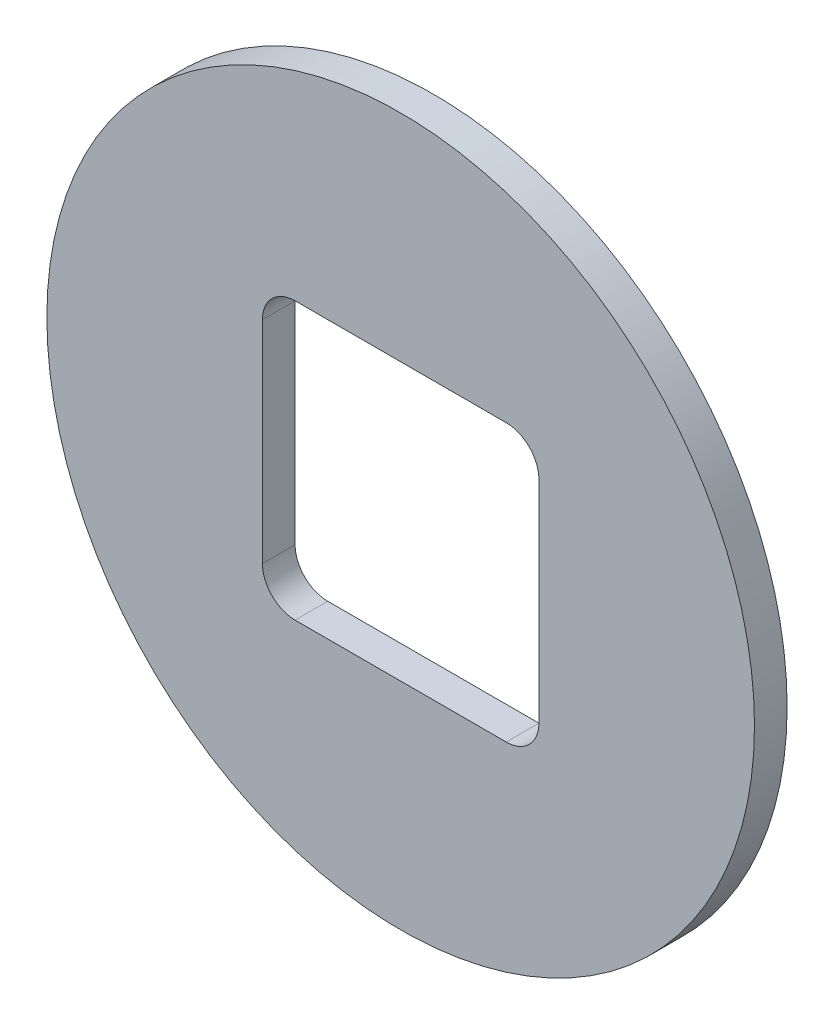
ISO-10303-21;
HEADER;
FILE_DESCRIPTION(('STEP AP214'),'2;1');
FILE_NAME('part.step','',(''),(''),'','','');
FILE_SCHEMA(('AUTOMOTIVE_DESIGN { 1 0 10303 214 1 1 1 1 }'));
ENDSEC;
DATA;
#1=APPLICATION_CONTEXT('core data for automotive mechanical design processes');
#2=APPLICATION_PROTOCOL_DEFINITION('international standard','automotive_design',2000,#1);
#3=PRODUCT_CONTEXT('',#1,'mechanical');
#4=PRODUCT('Part','Part','',(#3));
#5=PRODUCT_RELATED_PRODUCT_CATEGORY('part','',(#4));
#6=PRODUCT_DEFINITION_FORMATION('','',#4);
#7=PRODUCT_DEFINITION_CONTEXT('part definition',#1,'design');
#8=PRODUCT_DEFINITION('design','',#6,#7);
#9=PRODUCT_DEFINITION_SHAPE('','',#8);
#10=(LENGTH_UNIT() NAMED_UNIT(*) SI_UNIT(.MILLI.,.METRE.));
#11=(NAMED_UNIT(*) PLANE_ANGLE_UNIT() SI_UNIT($,.RADIAN.));
#12=(NAMED_UNIT(*) SI_UNIT($,.STERADIAN.) SOLID_ANGLE_UNIT());
#13=UNCERTAINTY_MEASURE_WITH_UNIT(LENGTH_MEASURE(1.E-05),#10,'distance_accuracy_value','');
#14=(GEOMETRIC_REPRESENTATION_CONTEXT(3) GLOBAL_UNCERTAINTY_ASSIGNED_CONTEXT((#13)) GLOBAL_UNIT_ASSIGNED_CONTEXT((#10,
#11,#12)) REPRESENTATION_CONTEXT('',''));
#15=CARTESIAN_POINT('',(0.,0.,0.));
#16=DIRECTION('',(0.,0.,1.));
#17=DIRECTION('',(1.,0.,0.));
#18=AXIS2_PLACEMENT_3D('',#15,#16,#17);
#19=CARTESIAN_POINT('',(0.,0.,0.));
#20=DIRECTION('',(0.,0.,1.));
#21=DIRECTION('',(1.,0.,0.));
#22=AXIS2_PLACEMENT_3D('',#19,#20,#21);
#23=PLANE('',#22);
#24=DIRECTION('',(1.,0.,0.));
#25=VECTOR('',#24,1.);
#26=CARTESIAN_POINT('',(12.7,-12.7,0.));
#27=LINE('',#26,#25);
#28=CARTESIAN_POINT('',(9.7,-12.7,0.));
#29=VERTEX_POINT('',#28);
#30=CARTESIAN_POINT('',(-9.7,-12.7,0.));
#31=VERTEX_POINT('',#30);
#32=EDGE_CURVE('E116',#29,#31,#27,.F.);
#33=ORIENTED_EDGE('',*,*,#32,.F.);
#34=CARTESIAN_POINT('',(9.7,-9.7,0.));
#35=DIRECTION('',(0.,0.,1.));
#36=DIRECTION('',(1.,0.,0.));
#37=AXIS2_PLACEMENT_3D('',#34,#35,#36);
#38=CIRCLE('',#37,3.);
#39=CARTESIAN_POINT('',(12.7,-9.7,0.));
#40=VERTEX_POINT('',#39);
#41=EDGE_CURVE('E87',#29,#40,#38,.T.);
#42=ORIENTED_EDGE('',*,*,#41,.T.);
#43=DIRECTION('',(0.,1.,0.));
#44=VECTOR('',#43,1.);
#45=CARTESIAN_POINT('',(12.7,12.7,0.));
#46=LINE('',#45,#44);
#47=CARTESIAN_POINT('',(12.7,9.7,0.));
#48=VERTEX_POINT('',#47);
#49=EDGE_CURVE('E80',#48,#40,#46,.F.);
#50=ORIENTED_EDGE('',*,*,#49,.F.);
#51=CARTESIAN_POINT('',(9.7,9.7,0.));
#52=DIRECTION('',(0.,0.,1.));
#53=DIRECTION('',(1.,0.,0.));
#54=AXIS2_PLACEMENT_3D('',#51,#52,#53);
#55=CIRCLE('',#54,3.);
#56=CARTESIAN_POINT('',(9.7,12.7,0.));
#57=VERTEX_POINT('',#56);
#58=EDGE_CURVE('E85',#48,#57,#55,.T.);
#59=ORIENTED_EDGE('',*,*,#58,.T.);
#60=DIRECTION('',(1.,0.,0.));
#61=VECTOR('',#60,1.);
#62=CARTESIAN_POINT('',(-12.7,12.7,0.));
#63=LINE('',#62,#61);
#64=CARTESIAN_POINT('',(-9.7,12.7,0.));
#65=VERTEX_POINT('',#64);
#66=EDGE_CURVE('E109',#65,#57,#63,.T.);
#67=ORIENTED_EDGE('',*,*,#66,.F.);
#68=CARTESIAN_POINT('',(-9.7,9.7,0.));
#69=DIRECTION('',(0.,0.,1.));
#70=DIRECTION('',(1.,0.,0.));
#71=AXIS2_PLACEMENT_3D('',#68,#69,#70);
#72=CIRCLE('',#71,3.);
#73=CARTESIAN_POINT('',(-12.7,9.7,0.));
#74=VERTEX_POINT('',#73);
#75=EDGE_CURVE('E114',#65,#74,#72,.T.);
#76=ORIENTED_EDGE('',*,*,#75,.T.);
#77=DIRECTION('',(0.,1.,0.));
#78=VECTOR('',#77,1.);
#79=CARTESIAN_POINT('',(-12.7,-12.7,0.));
#80=LINE('',#79,#78);
#81=CARTESIAN_POINT('',(-12.7,-9.7,0.));
#82=VERTEX_POINT('',#81);
#83=EDGE_CURVE('E111',#82,#74,#80,.T.);
#84=ORIENTED_EDGE('',*,*,#83,.F.);
#85=CARTESIAN_POINT('',(-9.7,-9.7,0.));
#86=DIRECTION('',(0.,0.,1.));
#87=DIRECTION('',(1.,0.,0.));
#88=AXIS2_PLACEMENT_3D('',#85,#86,#87);
#89=CIRCLE('',#88,3.);
#90=EDGE_CURVE('E118',#82,#31,#89,.T.);
#91=ORIENTED_EDGE('',*,*,#90,.T.);
#92=EDGE_LOOP('',(#33,#42,#50,#59,#67,#76,#84,#91));
#93=FACE_BOUND('',#92,.T.);
#94=CARTESIAN_POINT('',(0.,0.,0.));
#95=DIRECTION('',(0.,0.,1.));
#96=DIRECTION('',(1.,0.,0.));
#97=AXIS2_PLACEMENT_3D('',#94,#95,#96);
#98=CIRCLE('',#97,32.5);
#99=CARTESIAN_POINT('',(32.5,0.,0.));
#100=VERTEX_POINT('',#99);
#101=EDGE_CURVE('E21',#100,#100,#98,.T.);
#102=ORIENTED_EDGE('',*,*,#101,.F.);
#103=EDGE_LOOP('',(#102));
#104=FACE_BOUND('',#103,.T.);
#105=ADVANCED_FACE('F17',(#93,#104),#23,.F.);
#106=CARTESIAN_POINT('',(0.,0.,0.));
#107=DIRECTION('',(0.,0.,1.));
#108=DIRECTION('',(1.,0.,0.));
#109=AXIS2_PLACEMENT_3D('',#106,#107,#108);
#110=CYLINDRICAL_SURFACE('',#109,32.5);
#111=CARTESIAN_POINT('',(0.,0.,3.));
#112=DIRECTION('',(0.,0.,1.));
#113=DIRECTION('',(1.,0.,0.));
#114=AXIS2_PLACEMENT_3D('',#111,#112,#113);
#115=CIRCLE('',#114,32.5);
#116=CARTESIAN_POINT('',(32.5,0.,3.));
#117=VERTEX_POINT('',#116);
#118=EDGE_CURVE('E133',#117,#117,#115,.T.);
#119=ORIENTED_EDGE('',*,*,#118,.F.);
#120=EDGE_LOOP('',(#119));
#121=FACE_BOUND('',#120,.T.);
#122=ORIENTED_EDGE('',*,*,#101,.T.);
#123=EDGE_LOOP('',(#122));
#124=FACE_BOUND('',#123,.T.);
#125=ADVANCED_FACE('F191',(#121,#124),#110,.T.);
#126=CARTESIAN_POINT('',(9.7,9.7,-3.9108));
#127=DIRECTION('',(0.,0.,1.));
#128=DIRECTION('',(1.,0.,0.));
#129=AXIS2_PLACEMENT_3D('',#126,#127,#128);
#130=CYLINDRICAL_SURFACE('',#129,3.);
#131=DIRECTION('',(0.,0.,-1.));
#132=VECTOR('',#131,1.);
#133=CARTESIAN_POINT('',(9.7,12.7,0.));
#134=LINE('',#133,#132);
#135=CARTESIAN_POINT('',(9.7,12.7,3.));
#136=VERTEX_POINT('',#135);
#137=EDGE_CURVE('E97',#57,#136,#134,.F.);
#138=ORIENTED_EDGE('',*,*,#137,.F.);
#139=ORIENTED_EDGE('',*,*,#58,.F.);
#140=DIRECTION('',(0.,0.,1.));
#141=VECTOR('',#140,1.);
#142=CARTESIAN_POINT('',(12.7,9.7,0.));
#143=LINE('',#142,#141);
#144=CARTESIAN_POINT('',(12.7,9.7,3.));
#145=VERTEX_POINT('',#144);
#146=EDGE_CURVE('E91',#145,#48,#143,.F.);
#147=ORIENTED_EDGE('',*,*,#146,.F.);
#148=CARTESIAN_POINT('',(9.7,9.7,3.));
#149=DIRECTION('',(0.,0.,1.));
#150=DIRECTION('',(1.,0.,0.));
#151=AXIS2_PLACEMENT_3D('',#148,#149,#150);
#152=CIRCLE('',#151,3.);
#153=EDGE_CURVE('E131',#136,#145,#152,.F.);
#154=ORIENTED_EDGE('',*,*,#153,.F.);
#155=EDGE_LOOP('',(#138,#139,#147,#154));
#156=FACE_BOUND('',#155,.T.);
#157=ADVANCED_FACE('F94',(#156),#130,.F.);
#158=CARTESIAN_POINT('',(12.7,12.7,0.));
#159=DIRECTION('',(-1.,0.,0.));
#160=DIRECTION('',(0.,0.,1.));
#161=AXIS2_PLACEMENT_3D('',#158,#159,#160);
#162=PLANE('',#161);
#163=DIRECTION('',(0.,1.,0.));
#164=VECTOR('',#163,1.);
#165=CARTESIAN_POINT('',(12.7,0.,3.));
#166=LINE('',#165,#164);
#167=CARTESIAN_POINT('',(12.7,-9.7,3.));
#168=VERTEX_POINT('',#167);
#169=EDGE_CURVE('E101',#145,#168,#166,.F.);
#170=ORIENTED_EDGE('',*,*,#169,.F.);
#171=ORIENTED_EDGE('',*,*,#146,.T.);
#172=ORIENTED_EDGE('',*,*,#49,.T.);
#173=DIRECTION('',(0.,0.,1.));
#174=VECTOR('',#173,1.);
#175=CARTESIAN_POINT('',(12.7,-9.7,-3.9108));
#176=LINE('',#175,#174);
#177=EDGE_CURVE('E104',#40,#168,#176,.T.);
#178=ORIENTED_EDGE('',*,*,#177,.T.);
#179=EDGE_LOOP('',(#170,#171,#172,#178));
#180=FACE_BOUND('',#179,.T.);
#181=ADVANCED_FACE('F99',(#180),#162,.T.);
#182=CARTESIAN_POINT('',(9.7,-9.7,-3.9108));
#183=DIRECTION('',(0.,0.,1.));
#184=DIRECTION('',(1.,0.,0.));
#185=AXIS2_PLACEMENT_3D('',#182,#183,#184);
#186=CYLINDRICAL_SURFACE('',#185,3.);
#187=ORIENTED_EDGE('',*,*,#177,.F.);
#188=ORIENTED_EDGE('',*,*,#41,.F.);
#189=DIRECTION('',(0.,0.,1.));
#190=VECTOR('',#189,1.);
#191=CARTESIAN_POINT('',(9.7,-12.7,0.));
#192=LINE('',#191,#190);
#193=CARTESIAN_POINT('',(9.7,-12.7,3.));
#194=VERTEX_POINT('',#193);
#195=EDGE_CURVE('E119',#194,#29,#192,.F.);
#196=ORIENTED_EDGE('',*,*,#195,.F.);
#197=CARTESIAN_POINT('',(9.7,-9.7,3.));
#198=DIRECTION('',(0.,0.,1.));
#199=DIRECTION('',(1.,0.,0.));
#200=AXIS2_PLACEMENT_3D('',#197,#198,#199);
#201=CIRCLE('',#200,3.);
#202=EDGE_CURVE('E128',#168,#194,#201,.F.);
#203=ORIENTED_EDGE('',*,*,#202,.F.);
#204=EDGE_LOOP('',(#187,#188,#196,#203));
#205=FACE_BOUND('',#204,.T.);
#206=ADVANCED_FACE('F151',(#205),#186,.F.);
#207=CARTESIAN_POINT('',(12.7,-12.7,0.));
#208=DIRECTION('',(0.,1.,0.));
#209=DIRECTION('',(0.,0.,1.));
#210=AXIS2_PLACEMENT_3D('',#207,#208,#209);
#211=PLANE('',#210);
#212=ORIENTED_EDGE('',*,*,#32,.T.);
#213=DIRECTION('',(0.,0.,1.));
#214=VECTOR('',#213,1.);
#215=CARTESIAN_POINT('',(-9.7,-12.7,-3.9108));
#216=LINE('',#215,#214);
#217=CARTESIAN_POINT('',(-9.7,-12.7,3.));
#218=VERTEX_POINT('',#217);
#219=EDGE_CURVE('E138',#31,#218,#216,.T.);
#220=ORIENTED_EDGE('',*,*,#219,.T.);
#221=DIRECTION('',(1.,0.,0.));
#222=VECTOR('',#221,1.);
#223=CARTESIAN_POINT('',(0.,-12.7,3.));
#224=LINE('',#223,#222);
#225=EDGE_CURVE('E127',#194,#218,#224,.F.);
#226=ORIENTED_EDGE('',*,*,#225,.F.);
#227=ORIENTED_EDGE('',*,*,#195,.T.);
#228=EDGE_LOOP('',(#212,#220,#226,#227));
#229=FACE_BOUND('',#228,.T.);
#230=ADVANCED_FACE('F182',(#229),#211,.T.);
#231=CARTESIAN_POINT('',(-9.7,-9.7,-3.9108));
#232=DIRECTION('',(0.,0.,1.));
#233=DIRECTION('',(1.,0.,0.));
#234=AXIS2_PLACEMENT_3D('',#231,#232,#233);
#235=CYLINDRICAL_SURFACE('',#234,3.);
#236=ORIENTED_EDGE('',*,*,#219,.F.);
#237=ORIENTED_EDGE('',*,*,#90,.F.);
#238=DIRECTION('',(0.,0.,-1.));
#239=VECTOR('',#238,1.);
#240=CARTESIAN_POINT('',(-12.7,-9.7,0.));
#241=LINE('',#240,#239);
#242=CARTESIAN_POINT('',(-12.7,-9.7,3.));
#243=VERTEX_POINT('',#242);
#244=EDGE_CURVE('E115',#243,#82,#241,.T.);
#245=ORIENTED_EDGE('',*,*,#244,.F.);
#246=CARTESIAN_POINT('',(-9.7,-9.7,3.));
#247=DIRECTION('',(0.,0.,1.));
#248=DIRECTION('',(1.,0.,0.));
#249=AXIS2_PLACEMENT_3D('',#246,#247,#248);
#250=CIRCLE('',#249,3.);
#251=EDGE_CURVE('E124',#218,#243,#250,.F.);
#252=ORIENTED_EDGE('',*,*,#251,.F.);
#253=EDGE_LOOP('',(#236,#237,#245,#252));
#254=FACE_BOUND('',#253,.T.);
#255=ADVANCED_FACE('F167',(#254),#235,.F.);
#256=CARTESIAN_POINT('',(-12.7,-12.7,0.));
#257=DIRECTION('',(1.,0.,0.));
#258=DIRECTION('',(0.,0.,-1.));
#259=AXIS2_PLACEMENT_3D('',#256,#257,#258);
#260=PLANE('',#259);
#261=ORIENTED_EDGE('',*,*,#83,.T.);
#262=DIRECTION('',(0.,0.,1.));
#263=VECTOR('',#262,1.);
#264=CARTESIAN_POINT('',(-12.7,9.7,-3.9108));
#265=LINE('',#264,#263);
#266=CARTESIAN_POINT('',(-12.7,9.7,3.));
#267=VERTEX_POINT('',#266);
#268=EDGE_CURVE('E137',#74,#267,#265,.T.);
#269=ORIENTED_EDGE('',*,*,#268,.T.);
#270=DIRECTION('',(0.,1.,0.));
#271=VECTOR('',#270,1.);
#272=CARTESIAN_POINT('',(-12.7,0.,3.));
#273=LINE('',#272,#271);
#274=EDGE_CURVE('E123',#243,#267,#273,.T.);
#275=ORIENTED_EDGE('',*,*,#274,.F.);
#276=ORIENTED_EDGE('',*,*,#244,.T.);
#277=EDGE_LOOP('',(#261,#269,#275,#276));
#278=FACE_BOUND('',#277,.T.);
#279=ADVANCED_FACE('F163',(#278),#260,.T.);
#280=CARTESIAN_POINT('',(-9.7,9.7,-3.9108));
#281=DIRECTION('',(0.,0.,1.));
#282=DIRECTION('',(1.,0.,0.));
#283=AXIS2_PLACEMENT_3D('',#280,#281,#282);
#284=CYLINDRICAL_SURFACE('',#283,3.);
#285=ORIENTED_EDGE('',*,*,#268,.F.);
#286=ORIENTED_EDGE('',*,*,#75,.F.);
#287=DIRECTION('',(0.,0.,-1.));
#288=VECTOR('',#287,1.);
#289=CARTESIAN_POINT('',(-9.7,12.7,0.));
#290=LINE('',#289,#288);
#291=CARTESIAN_POINT('',(-9.7,12.7,3.));
#292=VERTEX_POINT('',#291);
#293=EDGE_CURVE('E36',#292,#65,#290,.T.);
#294=ORIENTED_EDGE('',*,*,#293,.F.);
#295=CARTESIAN_POINT('',(-9.7,9.7,3.));
#296=DIRECTION('',(0.,0.,1.));
#297=DIRECTION('',(1.,0.,0.));
#298=AXIS2_PLACEMENT_3D('',#295,#296,#297);
#299=CIRCLE('',#298,3.);
#300=EDGE_CURVE('E27',#267,#292,#299,.F.);
#301=ORIENTED_EDGE('',*,*,#300,.F.);
#302=EDGE_LOOP('',(#285,#286,#294,#301));
#303=FACE_BOUND('',#302,.T.);
#304=ADVANCED_FACE('F165',(#303),#284,.F.);
#305=CARTESIAN_POINT('',(-12.7,12.7,0.));
#306=DIRECTION('',(0.,-1.,0.));
#307=DIRECTION('',(0.,0.,-1.));
#308=AXIS2_PLACEMENT_3D('',#305,#306,#307);
#309=PLANE('',#308);
#310=ORIENTED_EDGE('',*,*,#66,.T.);
#311=ORIENTED_EDGE('',*,*,#137,.T.);
#312=DIRECTION('',(1.,0.,0.));
#313=VECTOR('',#312,1.);
#314=CARTESIAN_POINT('',(0.,12.7,3.));
#315=LINE('',#314,#313);
#316=EDGE_CURVE('E11',#292,#136,#315,.T.);
#317=ORIENTED_EDGE('',*,*,#316,.F.);
#318=ORIENTED_EDGE('',*,*,#293,.T.);
#319=EDGE_LOOP('',(#310,#311,#317,#318));
#320=FACE_BOUND('',#319,.T.);
#321=ADVANCED_FACE('F169',(#320),#309,.T.);
#322=CARTESIAN_POINT('',(0.,0.,3.));
#323=DIRECTION('',(0.,0.,1.));
#324=DIRECTION('',(1.,0.,0.));
#325=AXIS2_PLACEMENT_3D('',#322,#323,#324);
#326=PLANE('',#325);
#327=ORIENTED_EDGE('',*,*,#300,.T.);
#328=ORIENTED_EDGE('',*,*,#316,.T.);
#329=ORIENTED_EDGE('',*,*,#153,.T.);
#330=ORIENTED_EDGE('',*,*,#169,.T.);
#331=ORIENTED_EDGE('',*,*,#202,.T.);
#332=ORIENTED_EDGE('',*,*,#225,.T.);
#333=ORIENTED_EDGE('',*,*,#251,.T.);
#334=ORIENTED_EDGE('',*,*,#274,.T.);
#335=EDGE_LOOP('',(#327,#328,#329,#330,#331,#332,#333,#334));
#336=FACE_BOUND('',#335,.T.);
#337=ORIENTED_EDGE('',*,*,#118,.T.);
#338=EDGE_LOOP('',(#337));
#339=FACE_BOUND('',#338,.T.);
#340=ADVANCED_FACE('F19',(#336,#339),#326,.T.);
#341=CLOSED_SHELL('',(#105,#125,#157,#181,#206,#230,#255,#279,#304,#321,#340));
#342=MANIFOLD_SOLID_BREP('B1',#341);
#343=ADVANCED_BREP_SHAPE_REPRESENTATION('',(#18,#342),#14);
#344=SHAPE_DEFINITION_REPRESENTATION(#9,#343);
ENDSEC;
END-ISO-10303-21;
